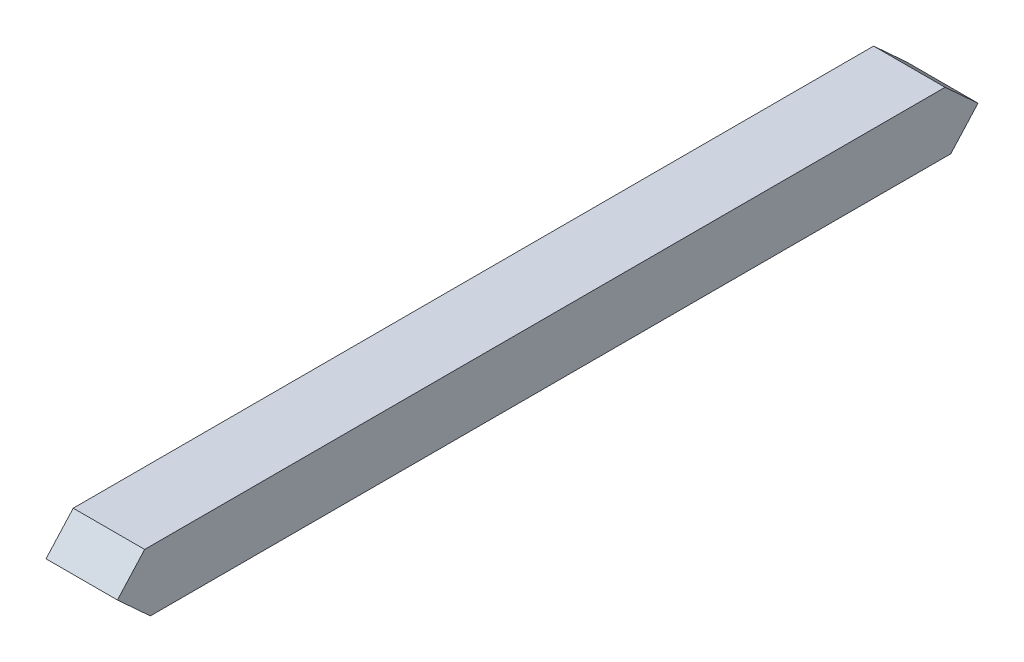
ISO-10303-21;
HEADER;
FILE_DESCRIPTION(('STEP AP214'),'2;1');
FILE_NAME('part.step','',(''),(''),'','','');
FILE_SCHEMA(('AUTOMOTIVE_DESIGN { 1 0 10303 214 1 1 1 1 }'));
ENDSEC;
DATA;
#1=APPLICATION_CONTEXT('core data for automotive mechanical design processes');
#2=APPLICATION_PROTOCOL_DEFINITION('international standard','automotive_design',2000,#1);
#3=PRODUCT_CONTEXT('',#1,'mechanical');
#4=PRODUCT('Part','Part','',(#3));
#5=PRODUCT_RELATED_PRODUCT_CATEGORY('part','',(#4));
#6=PRODUCT_DEFINITION_FORMATION('','',#4);
#7=PRODUCT_DEFINITION_CONTEXT('part definition',#1,'design');
#8=PRODUCT_DEFINITION('design','',#6,#7);
#9=PRODUCT_DEFINITION_SHAPE('','',#8);
#10=(LENGTH_UNIT() NAMED_UNIT(*) SI_UNIT(.MILLI.,.METRE.));
#11=(NAMED_UNIT(*) PLANE_ANGLE_UNIT() SI_UNIT($,.RADIAN.));
#12=(NAMED_UNIT(*) SI_UNIT($,.STERADIAN.) SOLID_ANGLE_UNIT());
#13=UNCERTAINTY_MEASURE_WITH_UNIT(LENGTH_MEASURE(1.E-05),#10,'distance_accuracy_value','');
#14=(GEOMETRIC_REPRESENTATION_CONTEXT(3) GLOBAL_UNCERTAINTY_ASSIGNED_CONTEXT((#13)) GLOBAL_UNIT_ASSIGNED_CONTEXT((#10,
#11,#12)) REPRESENTATION_CONTEXT('',''));
#15=CARTESIAN_POINT('',(0.,0.,0.));
#16=DIRECTION('',(0.,0.,1.));
#17=DIRECTION('',(1.,0.,0.));
#18=AXIS2_PLACEMENT_3D('',#15,#16,#17);
#19=CARTESIAN_POINT('',(32.5,27.5,783.));
#20=DIRECTION('',(-1.,0.,0.));
#21=DIRECTION('',(0.,-1.,0.));
#22=AXIS2_PLACEMENT_3D('',#19,#20,#21);
#23=PLANE('',#22);
#24=DIRECTION('',(0.,0.676249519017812,0.73667264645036));
#25=VECTOR('',#24,1.);
#26=CARTESIAN_POINT('',(32.5,5.96122261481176E-11,-5.99520433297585E-12));
#27=LINE('',#26,#25);
#28=CARTESIAN_POINT('',(32.5,5.96122261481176E-11,-5.99520433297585E-12));
#29=VERTEX_POINT('',#28);
#30=CARTESIAN_POINT('',(32.5,27.5000000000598,29.9571344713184));
#31=VERTEX_POINT('',#30);
#32=EDGE_CURVE('E176',#29,#31,#27,.T.);
#33=ORIENTED_EDGE('',*,*,#32,.T.);
#34=DIRECTION('',(0.,0.,-1.));
#35=VECTOR('',#34,1.);
#36=CARTESIAN_POINT('',(32.5,27.5,783.));
#37=LINE('',#36,#35);
#38=CARTESIAN_POINT('',(32.5,27.5,758.227080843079));
#39=VERTEX_POINT('',#38);
#40=EDGE_CURVE('E12',#39,#31,#37,.T.);
#41=ORIENTED_EDGE('',*,*,#40,.F.);
#42=DIRECTION('',(0.,0.742986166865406,-0.669306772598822));
#43=VECTOR('',#42,1.);
#44=CARTESIAN_POINT('',(32.5,0.,783.));
#45=LINE('',#44,#43);
#46=CARTESIAN_POINT('',(32.5,0.,783.));
#47=VERTEX_POINT('',#46);
#48=EDGE_CURVE('E138',#47,#39,#45,.T.);
#49=ORIENTED_EDGE('',*,*,#48,.F.);
#50=DIRECTION('',(0.,-0.676249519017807,-0.736672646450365));
#51=VECTOR('',#50,1.);
#52=CARTESIAN_POINT('',(32.5,0.,783.));
#53=LINE('',#52,#51);
#54=CARTESIAN_POINT('',(32.5,-27.5,753.042865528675));
#55=VERTEX_POINT('',#54);
#56=EDGE_CURVE('E190',#47,#55,#53,.T.);
#57=ORIENTED_EDGE('',*,*,#56,.T.);
#58=DIRECTION('',(0.,0.,-1.));
#59=VECTOR('',#58,1.);
#60=CARTESIAN_POINT('',(32.5,-27.5,783.));
#61=LINE('',#60,#59);
#62=CARTESIAN_POINT('',(32.5,-27.4999999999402,24.7729191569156));
#63=VERTEX_POINT('',#62);
#64=EDGE_CURVE('E182',#55,#63,#61,.T.);
#65=ORIENTED_EDGE('',*,*,#64,.T.);
#66=DIRECTION('',(0.,-0.742986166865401,0.669306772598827));
#67=VECTOR('',#66,1.);
#68=CARTESIAN_POINT('',(32.5,5.96122261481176E-11,-5.99520433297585E-12));
#69=LINE('',#68,#67);
#70=EDGE_CURVE('E195',#29,#63,#69,.T.);
#71=ORIENTED_EDGE('',*,*,#70,.F.);
#72=EDGE_LOOP('',(#33,#41,#49,#57,#65,#71));
#73=FACE_BOUND('',#72,.T.);
#74=ADVANCED_FACE('F104',(#73),#23,.F.);
#75=CARTESIAN_POINT('',(-32.5,27.5,783.));
#76=DIRECTION('',(1.,0.,0.));
#77=DIRECTION('',(0.,1.,0.));
#78=AXIS2_PLACEMENT_3D('',#75,#76,#77);
#79=PLANE('',#78);
#80=DIRECTION('',(0.,0.676249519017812,0.73667264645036));
#81=VECTOR('',#80,1.);
#82=CARTESIAN_POINT('',(-32.5,5.96122261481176E-11,-5.99520433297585E-12));
#83=LINE('',#82,#81);
#84=CARTESIAN_POINT('',(-32.5,5.96122261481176E-11,-5.99520433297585E-12));
#85=VERTEX_POINT('',#84);
#86=CARTESIAN_POINT('',(-32.5,27.5000000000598,29.9571344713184));
#87=VERTEX_POINT('',#86);
#88=EDGE_CURVE('E160',#85,#87,#83,.T.);
#89=ORIENTED_EDGE('',*,*,#88,.F.);
#90=DIRECTION('',(0.,-0.742986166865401,0.669306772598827));
#91=VECTOR('',#90,1.);
#92=CARTESIAN_POINT('',(-32.5,5.96122261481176E-11,-5.99520433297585E-12));
#93=LINE('',#92,#91);
#94=CARTESIAN_POINT('',(-32.5,-27.4999999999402,24.7729191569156));
#95=VERTEX_POINT('',#94);
#96=EDGE_CURVE('E201',#85,#95,#93,.T.);
#97=ORIENTED_EDGE('',*,*,#96,.T.);
#98=DIRECTION('',(0.,0.,-1.));
#99=VECTOR('',#98,1.);
#100=CARTESIAN_POINT('',(-32.5,-27.5,783.));
#101=LINE('',#100,#99);
#102=CARTESIAN_POINT('',(-32.5,-27.5,753.042865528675));
#103=VERTEX_POINT('',#102);
#104=EDGE_CURVE('E180',#103,#95,#101,.T.);
#105=ORIENTED_EDGE('',*,*,#104,.F.);
#106=DIRECTION('',(0.,-0.676249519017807,-0.736672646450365));
#107=VECTOR('',#106,1.);
#108=CARTESIAN_POINT('',(-32.5,0.,783.));
#109=LINE('',#108,#107);
#110=CARTESIAN_POINT('',(-32.5,0.,783.));
#111=VERTEX_POINT('',#110);
#112=EDGE_CURVE('E188',#111,#103,#109,.T.);
#113=ORIENTED_EDGE('',*,*,#112,.F.);
#114=DIRECTION('',(0.,0.742986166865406,-0.669306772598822));
#115=VECTOR('',#114,1.);
#116=CARTESIAN_POINT('',(-32.5,0.,783.));
#117=LINE('',#116,#115);
#118=CARTESIAN_POINT('',(-32.5,27.5,758.227080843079));
#119=VERTEX_POINT('',#118);
#120=EDGE_CURVE('E119',#111,#119,#117,.T.);
#121=ORIENTED_EDGE('',*,*,#120,.T.);
#122=DIRECTION('',(0.,0.,-1.));
#123=VECTOR('',#122,1.);
#124=CARTESIAN_POINT('',(-32.5,27.5,783.));
#125=LINE('',#124,#123);
#126=EDGE_CURVE('E112',#119,#87,#125,.T.);
#127=ORIENTED_EDGE('',*,*,#126,.T.);
#128=EDGE_LOOP('',(#89,#97,#105,#113,#121,#127));
#129=FACE_BOUND('',#128,.T.);
#130=ADVANCED_FACE('F178',(#129),#79,.F.);
#131=CARTESIAN_POINT('',(-32.5,27.5,783.));
#132=DIRECTION('',(0.,-1.,0.));
#133=DIRECTION('',(0.,0.,-1.));
#134=AXIS2_PLACEMENT_3D('',#131,#132,#133);
#135=PLANE('',#134);
#136=DIRECTION('',(1.,0.,0.));
#137=VECTOR('',#136,1.);
#138=CARTESIAN_POINT('',(-32.5,27.5000000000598,29.9571344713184));
#139=LINE('',#138,#137);
#140=EDGE_CURVE('E163',#87,#31,#139,.T.);
#141=ORIENTED_EDGE('',*,*,#140,.F.);
#142=ORIENTED_EDGE('',*,*,#126,.F.);
#143=DIRECTION('',(1.,0.,0.));
#144=VECTOR('',#143,1.);
#145=CARTESIAN_POINT('',(-32.5,27.5,758.227080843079));
#146=LINE('',#145,#144);
#147=EDGE_CURVE('E193',#119,#39,#146,.T.);
#148=ORIENTED_EDGE('',*,*,#147,.T.);
#149=ORIENTED_EDGE('',*,*,#40,.T.);
#150=EDGE_LOOP('',(#141,#142,#148,#149));
#151=FACE_BOUND('',#150,.T.);
#152=ADVANCED_FACE('F174',(#151),#135,.F.);
#153=CARTESIAN_POINT('',(-32.5,-27.5,783.));
#154=DIRECTION('',(0.,1.,0.));
#155=DIRECTION('',(0.,0.,1.));
#156=AXIS2_PLACEMENT_3D('',#153,#154,#155);
#157=PLANE('',#156);
#158=ORIENTED_EDGE('',*,*,#104,.T.);
#159=DIRECTION('',(1.,0.,0.));
#160=VECTOR('',#159,1.);
#161=CARTESIAN_POINT('',(-32.5,-27.4999999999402,24.7729191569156));
#162=LINE('',#161,#160);
#163=EDGE_CURVE('E199',#95,#63,#162,.T.);
#164=ORIENTED_EDGE('',*,*,#163,.T.);
#165=ORIENTED_EDGE('',*,*,#64,.F.);
#166=DIRECTION('',(1.,0.,0.));
#167=VECTOR('',#166,1.);
#168=CARTESIAN_POINT('',(-32.5,-27.5,753.042865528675));
#169=LINE('',#168,#167);
#170=EDGE_CURVE('E130',#103,#55,#169,.T.);
#171=ORIENTED_EDGE('',*,*,#170,.F.);
#172=EDGE_LOOP('',(#158,#164,#165,#171));
#173=FACE_BOUND('',#172,.T.);
#174=ADVANCED_FACE('F211',(#173),#157,.F.);
#175=CARTESIAN_POINT('',(-32.5,0.,783.));
#176=DIRECTION('',(0.,-0.736672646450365,0.676249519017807));
#177=DIRECTION('',(0.,-0.676249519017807,-0.736672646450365));
#178=AXIS2_PLACEMENT_3D('',#175,#176,#177);
#179=PLANE('',#178);
#180=DIRECTION('',(1.,0.,0.));
#181=VECTOR('',#180,1.);
#182=CARTESIAN_POINT('',(-32.5,0.,783.));
#183=LINE('',#182,#181);
#184=EDGE_CURVE('E134',#111,#47,#183,.T.);
#185=ORIENTED_EDGE('',*,*,#184,.F.);
#186=ORIENTED_EDGE('',*,*,#112,.T.);
#187=ORIENTED_EDGE('',*,*,#170,.T.);
#188=ORIENTED_EDGE('',*,*,#56,.F.);
#189=EDGE_LOOP('',(#185,#186,#187,#188));
#190=FACE_BOUND('',#189,.T.);
#191=ADVANCED_FACE('F213',(#190),#179,.T.);
#192=CARTESIAN_POINT('',(-32.5,0.,783.));
#193=DIRECTION('',(0.,-0.669306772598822,-0.742986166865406));
#194=DIRECTION('',(0.,0.742986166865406,-0.669306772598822));
#195=AXIS2_PLACEMENT_3D('',#192,#193,#194);
#196=PLANE('',#195);
#197=ORIENTED_EDGE('',*,*,#147,.F.);
#198=ORIENTED_EDGE('',*,*,#120,.F.);
#199=ORIENTED_EDGE('',*,*,#184,.T.);
#200=ORIENTED_EDGE('',*,*,#48,.T.);
#201=EDGE_LOOP('',(#197,#198,#199,#200));
#202=FACE_BOUND('',#201,.T.);
#203=ADVANCED_FACE('F215',(#202),#196,.F.);
#204=CARTESIAN_POINT('',(-32.5,5.96122261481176E-11,-5.99520433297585E-12));
#205=DIRECTION('',(0.,0.669306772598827,0.742986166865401));
#206=DIRECTION('',(0.,-0.742986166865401,0.669306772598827));
#207=AXIS2_PLACEMENT_3D('',#204,#205,#206);
#208=PLANE('',#207);
#209=ORIENTED_EDGE('',*,*,#163,.F.);
#210=ORIENTED_EDGE('',*,*,#96,.F.);
#211=DIRECTION('',(1.,0.,0.));
#212=VECTOR('',#211,1.);
#213=CARTESIAN_POINT('',(-32.5,5.96122261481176E-11,-5.99520433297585E-12));
#214=LINE('',#213,#212);
#215=EDGE_CURVE('E166',#85,#29,#214,.T.);
#216=ORIENTED_EDGE('',*,*,#215,.T.);
#217=ORIENTED_EDGE('',*,*,#70,.T.);
#218=EDGE_LOOP('',(#209,#210,#216,#217));
#219=FACE_BOUND('',#218,.T.);
#220=ADVANCED_FACE('F208',(#219),#208,.F.);
#221=CARTESIAN_POINT('',(-32.5,5.96122261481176E-11,-5.99520433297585E-12));
#222=DIRECTION('',(0.,0.73667264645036,-0.676249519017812));
#223=DIRECTION('',(0.,0.676249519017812,0.73667264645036));
#224=AXIS2_PLACEMENT_3D('',#221,#222,#223);
#225=PLANE('',#224);
#226=ORIENTED_EDGE('',*,*,#215,.F.);
#227=ORIENTED_EDGE('',*,*,#88,.T.);
#228=ORIENTED_EDGE('',*,*,#140,.T.);
#229=ORIENTED_EDGE('',*,*,#32,.F.);
#230=EDGE_LOOP('',(#226,#227,#228,#229));
#231=FACE_BOUND('',#230,.T.);
#232=ADVANCED_FACE('F162',(#231),#225,.T.);
#233=CLOSED_SHELL('',(#74,#130,#152,#174,#191,#203,#220,#232));
#234=MANIFOLD_SOLID_BREP('B2',#233);
#235=ADVANCED_BREP_SHAPE_REPRESENTATION('',(#18,#234),#14);
#236=SHAPE_DEFINITION_REPRESENTATION(#9,#235);
ENDSEC;
END-ISO-10303-21;
